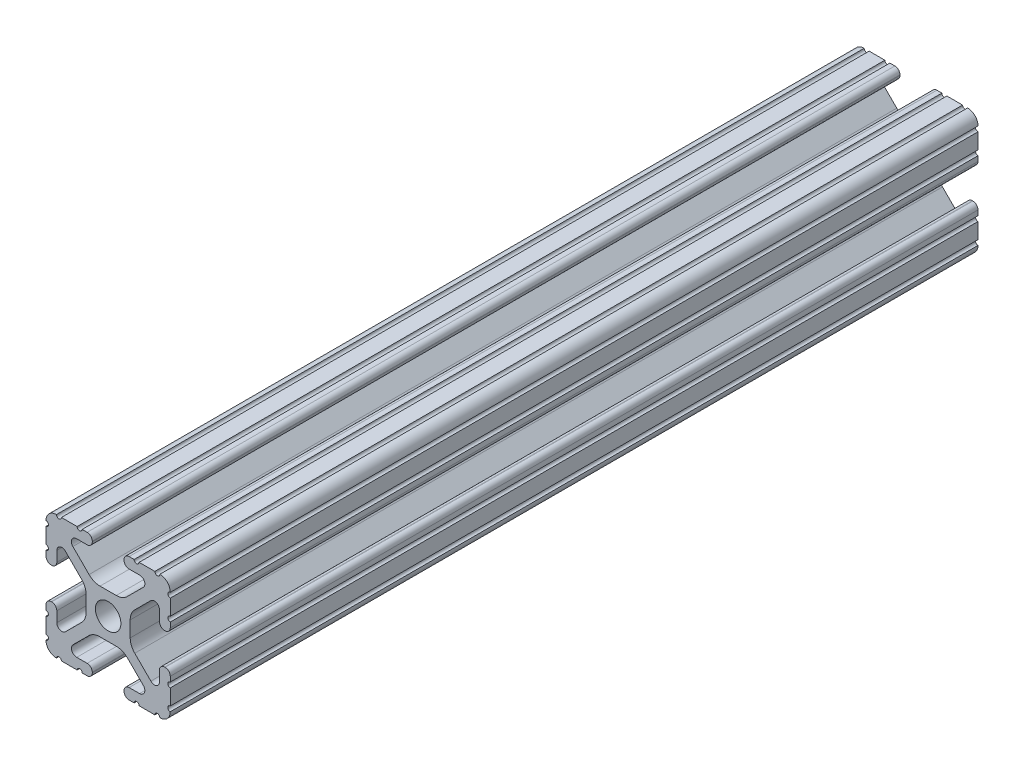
from build123d import *

# Parameters (mm, degrees)
SKETCH1_R           = 2.6035
BOSS_EXTRUDE1_DEPTH = 82.55


with BuildPart() as part:
    # Sketch1 → Boss-Extrude1 (new, symmetric)
    with BuildSketch(Plane.XY):
        with BuildLine():
            Line((-7.179650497, -8.645192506), (-3.952270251, -5.423690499))
            ThreePointArc((-3.952270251, -5.423690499), (-2.922936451, -4.736929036), (-1.709253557, -4.4958))
            Line((-1.709253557, -4.4958), (1.709253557, -4.4958))
            ThreePointArc((1.709253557, -4.4958), (2.922936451, -4.736929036), (3.952270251, -5.423690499))
            Line((3.952270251, -5.423690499), (7.179650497, -8.645192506))
            ThreePointArc((7.179650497, -8.645192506), (7.41473083, -9.822813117), (6.416408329, -10.4902))
            Line((6.416408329, -10.4902), (4.287512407, -10.4902))
            ThreePointArc((4.287512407, -10.4902), (3.54574862, -10.79744862), (3.2385, -11.539212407))
            Line((3.2385, -11.539212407), (3.2385, -11.650987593))
            ThreePointArc((3.2385, -11.650987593), (3.54574862, -12.39275138), (4.287512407, -12.7))
            Line((4.287512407, -12.7), (5.317126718, -12.7))
            ThreePointArc((5.317126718, -12.7), (5.825126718, -12.192), (6.333126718, -12.7))
            Line((6.333126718, -12.7), (9.550443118, -12.7))
            ThreePointArc((9.550443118, -12.7), (10.058366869, -12.192000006), (10.566443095, -12.699847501))
            ThreePointArc((10.566443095, -12.699847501), (12.082537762, -12.08250727), (12.699846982, -10.566399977))
            ThreePointArc((12.699846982, -10.566399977), (12.192000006, -10.058323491), (12.7, -9.5504))
            Line((12.7, -9.5504), (12.7, -6.3330836))
            ThreePointArc((12.7, -6.3330836), (12.192, -5.8250836), (12.7, -5.3170836))
            Line((12.7, -5.3170836), (12.7, -4.287469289))
            ThreePointArc((12.7, -4.287469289), (12.39275138, -3.545705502), (11.650987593, -3.238456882))
            Line((11.650987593, -3.238456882), (11.539212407, -3.238456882))
            ThreePointArc((11.539212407, -3.238456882), (10.79744862, -3.545705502), (10.4902, -4.287469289))
            Line((10.4902, -4.287469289), (10.4902, -6.402089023))
            ThreePointArc((10.4902, -6.402089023), (9.856505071, -7.351067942), (8.737131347, -7.129408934))
            Line((8.737131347, -7.129408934), (5.441005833, -3.840816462))
            ThreePointArc((5.441005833, -3.840816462), (4.750877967, -2.809883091), (4.5085, -1.593185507))
            Line((4.5085, -1.593185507), (4.5085, 1.593185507))
            ThreePointArc((4.5085, 1.593185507), (4.750877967, 2.809883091), (5.441005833, 3.840816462))
            Line((5.441005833, 3.840816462), (8.737131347, 7.129408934))
            ThreePointArc((8.737131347, 7.129408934), (9.856505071, 7.351067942), (10.4902, 6.402089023))
            Line((10.4902, 6.402089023), (10.4902, 4.287469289))
            ThreePointArc((10.4902, 4.287469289), (10.79744862, 3.545705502), (11.539212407, 3.238456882))
            Line((11.539212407, 3.238456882), (11.650987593, 3.238456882))
            ThreePointArc((11.650987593, 3.238456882), (12.39275138, 3.545705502), (12.7, 4.287469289))
            Line((12.7, 4.287469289), (12.7, 5.3170836))
            ThreePointArc((12.7, 5.3170836), (12.192, 5.8250836), (12.7, 6.3330836))
            Line((12.7, 6.3330836), (12.7, 9.5504))
            ThreePointArc((12.7, 9.5504), (12.192000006, 10.058323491), (12.699846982, 10.566399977))
            ThreePointArc((12.699846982, 10.566399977), (12.082537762, 12.08250727), (10.566443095, 12.699847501))
            ThreePointArc((10.566443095, 12.699847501), (10.058366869, 12.192000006), (9.550443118, 12.7))
            Line((9.550443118, 12.7), (6.333126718, 12.7))
            ThreePointArc((6.333126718, 12.7), (5.825126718, 12.192), (5.317126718, 12.7))
            Line((5.317126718, 12.7), (4.287512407, 12.7))
            ThreePointArc((4.287512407, 12.7), (3.54574862, 12.39275138), (3.2385, 11.650987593))
            Line((3.2385, 11.650987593), (3.2385, 11.539212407))
            ThreePointArc((3.2385, 11.539212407), (3.54574862, 10.79744862), (4.287512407, 10.4902))
            Line((4.287512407, 10.4902), (6.476788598, 10.4902))
            ThreePointArc((6.476788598, 10.4902), (7.432222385, 9.85140422), (7.207036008, 8.724370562))
            Line((7.207036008, 8.724370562), (3.898272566, 5.423169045))
            ThreePointArc((3.898272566, 5.423169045), (2.869120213, 4.736787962), (1.655778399, 4.4958))
            Line((1.655778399, 4.4958), (-1.655778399, 4.4958))
            ThreePointArc((-1.655778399, 4.4958), (-2.869120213, 4.736787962), (-3.898272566, 5.423169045))
            Line((-3.898272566, 5.423169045), (-7.207036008, 8.724370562))
            ThreePointArc((-7.207036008, 8.724370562), (-7.432222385, 9.85140422), (-6.476788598, 10.4902))
            Line((-6.476788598, 10.4902), (-4.287512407, 10.4902))
            ThreePointArc((-4.287512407, 10.4902), (-3.54574862, 10.79744862), (-3.2385, 11.539212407))
            Line((-3.2385, 11.539212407), (-3.2385, 11.650987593))
            ThreePointArc((-3.2385, 11.650987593), (-3.54574862, 12.39275138), (-4.287512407, 12.7))
            Line((-4.287512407, 12.7), (-5.317126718, 12.7))
            ThreePointArc((-5.317126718, 12.7), (-5.825126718, 12.192), (-6.333126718, 12.7))
            Line((-6.333126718, 12.7), (-9.550443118, 12.7))
            ThreePointArc((-9.550443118, 12.7), (-10.058366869, 12.192000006), (-10.566443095, 12.699847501))
            ThreePointArc((-10.566443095, 12.699847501), (-12.082537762, 12.08250727), (-12.699846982, 10.566399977))
            ThreePointArc((-12.699846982, 10.566399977), (-12.192000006, 10.058323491), (-12.7, 9.5504))
            Line((-12.7, 9.5504), (-12.7, 6.3330836))
            ThreePointArc((-12.7, 6.3330836), (-12.192, 5.8250836), (-12.7, 5.3170836))
            Line((-12.7, 5.3170836), (-12.7, 4.287469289))
            ThreePointArc((-12.7, 4.287469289), (-12.39275138, 3.545705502), (-11.650987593, 3.238456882))
            Line((-11.650987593, 3.238456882), (-11.539212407, 3.238456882))
            ThreePointArc((-11.539212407, 3.238456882), (-10.79744862, 3.545705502), (-10.4902, 4.287469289))
            Line((-10.4902, 4.287469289), (-10.4902, 6.402089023))
            ThreePointArc((-10.4902, 6.402089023), (-9.856505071, 7.351067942), (-8.737131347, 7.129408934))
            Line((-8.737131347, 7.129408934), (-5.441005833, 3.840816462))
            ThreePointArc((-5.441005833, 3.840816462), (-4.750877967, 2.809883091), (-4.5085, 1.593185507))
            Line((-4.5085, 1.593185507), (-4.5085, -1.593185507))
            ThreePointArc((-4.5085, -1.593185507), (-4.750877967, -2.809883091), (-5.441005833, -3.840816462))
            Line((-5.441005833, -3.840816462), (-8.737131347, -7.129408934))
            ThreePointArc((-8.737131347, -7.129408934), (-9.856505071, -7.351067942), (-10.4902, -6.402089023))
            Line((-10.4902, -6.402089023), (-10.4902, -4.287469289))
            ThreePointArc((-10.4902, -4.287469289), (-10.79744862, -3.545705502), (-11.539212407, -3.238456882))
            Line((-11.539212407, -3.238456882), (-11.650987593, -3.238456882))
            ThreePointArc((-11.650987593, -3.238456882), (-12.39275138, -3.545705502), (-12.7, -4.287469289))
            Line((-12.7, -4.287469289), (-12.7, -5.3170836))
            ThreePointArc((-12.7, -5.3170836), (-12.192, -5.8250836), (-12.7, -6.3330836))
            Line((-12.7, -6.3330836), (-12.7, -9.5504))
            ThreePointArc((-12.7, -9.5504), (-12.192000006, -10.058323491), (-12.699846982, -10.566399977))
            ThreePointArc((-12.699846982, -10.566399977), (-12.082537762, -12.08250727), (-10.566443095, -12.699847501))
            ThreePointArc((-10.566443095, -12.699847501), (-10.058366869, -12.192000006), (-9.550443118, -12.7))
            Line((-9.550443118, -12.7), (-6.333126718, -12.7))
            ThreePointArc((-6.333126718, -12.7), (-5.825126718, -12.192), (-5.317126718, -12.7))
            Line((-5.317126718, -12.7), (-4.287512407, -12.7))
            ThreePointArc((-4.287512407, -12.7), (-3.54574862, -12.39275138), (-3.2385, -11.650987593))
            Line((-3.2385, -11.650987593), (-3.2385, -11.539212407))
            ThreePointArc((-3.2385, -11.539212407), (-3.54574862, -10.79744862), (-4.287512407, -10.4902))
            Line((-4.287512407, -10.4902), (-6.416408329, -10.4902))
            ThreePointArc((-6.416408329, -10.4902), (-7.41473083, -9.822813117), (-7.179650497, -8.645192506))
        make_face()
        Circle(SKETCH1_R, mode=Mode.SUBTRACT)
    extrude(amount=BOSS_EXTRUDE1_DEPTH, both=True)


solid = part.part
